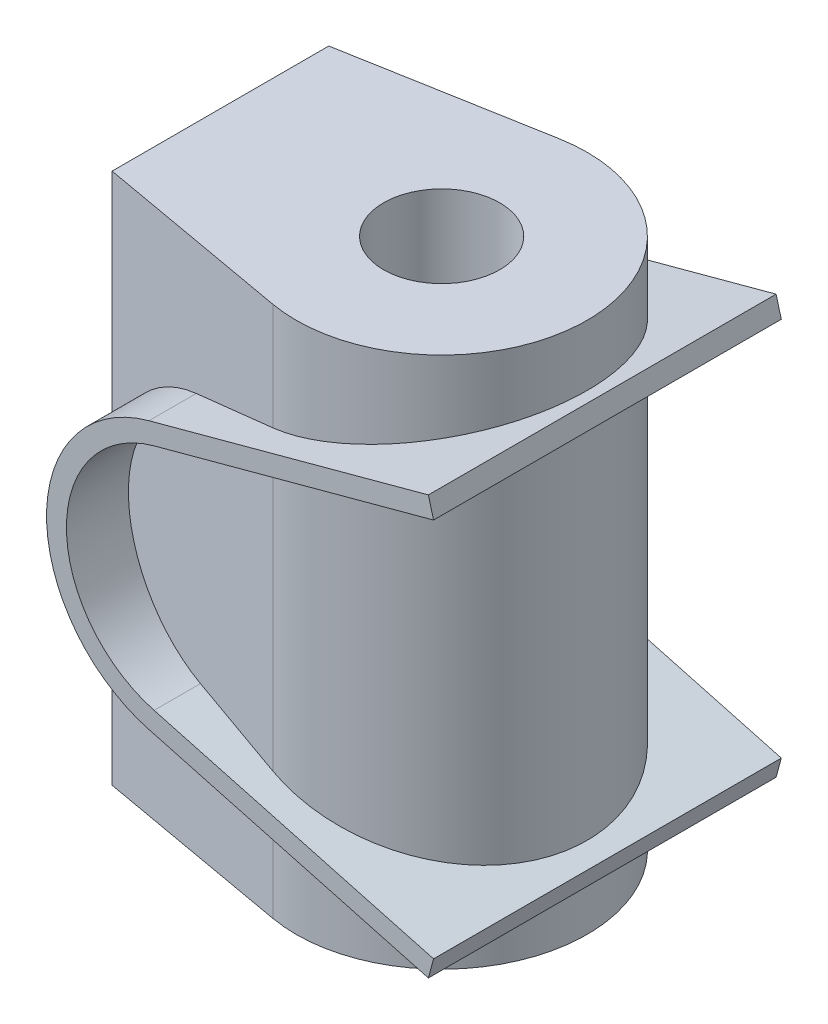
ISO-10303-21;
HEADER;
FILE_DESCRIPTION(('STEP AP214'),'2;1');
FILE_NAME('part.step','',(''),(''),'','','');
FILE_SCHEMA(('AUTOMOTIVE_DESIGN { 1 0 10303 214 1 1 1 1 }'));
ENDSEC;
DATA;
#1=APPLICATION_CONTEXT('core data for automotive mechanical design processes');
#2=APPLICATION_PROTOCOL_DEFINITION('international standard','automotive_design',2000,#1);
#3=PRODUCT_CONTEXT('',#1,'mechanical');
#4=PRODUCT('Part','Part','',(#3));
#5=PRODUCT_RELATED_PRODUCT_CATEGORY('part','',(#4));
#6=PRODUCT_DEFINITION_FORMATION('','',#4);
#7=PRODUCT_DEFINITION_CONTEXT('part definition',#1,'design');
#8=PRODUCT_DEFINITION('design','',#6,#7);
#9=PRODUCT_DEFINITION_SHAPE('','',#8);
#10=(LENGTH_UNIT() NAMED_UNIT(*) SI_UNIT(.MILLI.,.METRE.));
#11=(NAMED_UNIT(*) PLANE_ANGLE_UNIT() SI_UNIT($,.RADIAN.));
#12=(NAMED_UNIT(*) SI_UNIT($,.STERADIAN.) SOLID_ANGLE_UNIT());
#13=UNCERTAINTY_MEASURE_WITH_UNIT(LENGTH_MEASURE(1.E-05),#10,'distance_accuracy_value','');
#14=(GEOMETRIC_REPRESENTATION_CONTEXT(3) GLOBAL_UNCERTAINTY_ASSIGNED_CONTEXT((#13)) GLOBAL_UNIT_ASSIGNED_CONTEXT((#10,
#11,#12)) REPRESENTATION_CONTEXT('',''));
#15=CARTESIAN_POINT('',(0.,0.,0.));
#16=DIRECTION('',(0.,0.,1.));
#17=DIRECTION('',(1.,0.,0.));
#18=AXIS2_PLACEMENT_3D('',#15,#16,#17);
#19=CARTESIAN_POINT('',(10.5737978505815,33.9945272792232,0.));
#20=DIRECTION('',(0.,-1.,0.));
#21=DIRECTION('',(0.,0.,-1.));
#22=AXIS2_PLACEMENT_3D('',#19,#20,#21);
#23=PLANE('',#22);
#24=DIRECTION('',(0.,0.,1.));
#25=VECTOR('',#24,1.);
#26=CARTESIAN_POINT('',(-17.7041983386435,33.9945272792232,13.8475314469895));
#27=LINE('',#26,#25);
#28=CARTESIAN_POINT('',(-17.7041983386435,33.9945272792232,-13.8475314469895));
#29=VERTEX_POINT('',#28);
#30=CARTESIAN_POINT('',(-17.7041983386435,33.9945272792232,13.8475314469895));
#31=VERTEX_POINT('',#30);
#32=EDGE_CURVE('E105',#29,#31,#27,.T.);
#33=ORIENTED_EDGE('',*,*,#32,.T.);
#34=DIRECTION('',(0.984431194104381,0.,0.175770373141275));
#35=VECTOR('',#34,1.);
#36=CARTESIAN_POINT('',(7.30405130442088,33.9945272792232,18.3127590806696));
#37=LINE('',#36,#35);
#38=CARTESIAN_POINT('',(7.30405130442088,33.9945272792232,18.3127590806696));
#39=VERTEX_POINT('',#38);
#40=EDGE_CURVE('E90',#31,#39,#37,.T.);
#41=ORIENTED_EDGE('',*,*,#40,.T.);
#42=CARTESIAN_POINT('',(10.5737978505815,33.9945272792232,0.));
#43=DIRECTION('',(0.,1.,0.));
#44=DIRECTION('',(0.,0.,-1.));
#45=AXIS2_PLACEMENT_3D('',#42,#43,#44);
#46=CIRCLE('',#45,18.6023758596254);
#47=CARTESIAN_POINT('',(7.30405130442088,33.9945272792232,-18.3127590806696));
#48=VERTEX_POINT('',#47);
#49=EDGE_CURVE('E56',#39,#48,#46,.T.);
#50=ORIENTED_EDGE('',*,*,#49,.T.);
#51=DIRECTION('',(-0.984431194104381,0.,0.175770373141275));
#52=VECTOR('',#51,1.);
#53=CARTESIAN_POINT('',(-17.7041983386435,33.9945272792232,-13.8475314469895));
#54=LINE('',#53,#52);
#55=EDGE_CURVE('E51',#48,#29,#54,.T.);
#56=ORIENTED_EDGE('',*,*,#55,.T.);
#57=EDGE_LOOP('',(#33,#41,#50,#56));
#58=FACE_BOUND('',#57,.T.);
#59=CARTESIAN_POINT('',(10.5737978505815,33.9945272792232,0.));
#60=DIRECTION('',(0.,1.,0.));
#61=DIRECTION('',(0.,0.,1.));
#62=AXIS2_PLACEMENT_3D('',#59,#60,#61);
#63=CIRCLE('',#62,7.42305387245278);
#64=CARTESIAN_POINT('',(10.5737978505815,33.9945272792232,7.42305387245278));
#65=VERTEX_POINT('',#64);
#66=EDGE_CURVE('E95',#65,#65,#63,.T.);
#67=ORIENTED_EDGE('',*,*,#66,.F.);
#68=EDGE_LOOP('',(#67));
#69=FACE_BOUND('',#68,.T.);
#70=ADVANCED_FACE('F36',(#58,#69),#23,.F.);
#71=CARTESIAN_POINT('',(10.5737978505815,-33.9945272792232,0.));
#72=DIRECTION('',(0.,-1.,0.));
#73=DIRECTION('',(0.,0.,-1.));
#74=AXIS2_PLACEMENT_3D('',#71,#72,#73);
#75=PLANE('',#74);
#76=DIRECTION('',(0.,0.,1.));
#77=VECTOR('',#76,1.);
#78=CARTESIAN_POINT('',(-17.7041983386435,-33.9945272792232,13.8475314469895));
#79=LINE('',#78,#77);
#80=CARTESIAN_POINT('',(-17.7041983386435,-33.9945272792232,-13.8475314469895));
#81=VERTEX_POINT('',#80);
#82=CARTESIAN_POINT('',(-17.7041983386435,-33.9945272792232,13.8475314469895));
#83=VERTEX_POINT('',#82);
#84=EDGE_CURVE('E82',#81,#83,#79,.T.);
#85=ORIENTED_EDGE('',*,*,#84,.F.);
#86=DIRECTION('',(-0.984431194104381,0.,0.175770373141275));
#87=VECTOR('',#86,1.);
#88=CARTESIAN_POINT('',(-17.7041983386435,-33.9945272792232,-13.8475314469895));
#89=LINE('',#88,#87);
#90=CARTESIAN_POINT('',(7.30405130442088,-33.9945272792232,-18.3127590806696));
#91=VERTEX_POINT('',#90);
#92=EDGE_CURVE('E103',#91,#81,#89,.T.);
#93=ORIENTED_EDGE('',*,*,#92,.F.);
#94=CARTESIAN_POINT('',(10.5737978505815,-33.9945272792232,0.));
#95=DIRECTION('',(0.,1.,0.));
#96=DIRECTION('',(0.,0.,-1.));
#97=AXIS2_PLACEMENT_3D('',#94,#95,#96);
#98=CIRCLE('',#97,18.6023758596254);
#99=CARTESIAN_POINT('',(7.30405130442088,-33.9945272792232,18.3127590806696));
#100=VERTEX_POINT('',#99);
#101=EDGE_CURVE('E83',#100,#91,#98,.T.);
#102=ORIENTED_EDGE('',*,*,#101,.F.);
#103=DIRECTION('',(0.984431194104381,0.,0.175770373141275));
#104=VECTOR('',#103,1.);
#105=CARTESIAN_POINT('',(7.30405130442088,-33.9945272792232,18.3127590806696));
#106=LINE('',#105,#104);
#107=EDGE_CURVE('E77',#83,#100,#106,.T.);
#108=ORIENTED_EDGE('',*,*,#107,.F.);
#109=EDGE_LOOP('',(#85,#93,#102,#108));
#110=FACE_BOUND('',#109,.T.);
#111=CARTESIAN_POINT('',(10.5737978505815,-33.9945272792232,0.));
#112=DIRECTION('',(0.,1.,0.));
#113=DIRECTION('',(0.,0.,1.));
#114=AXIS2_PLACEMENT_3D('',#111,#112,#113);
#115=CIRCLE('',#114,7.42305387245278);
#116=CARTESIAN_POINT('',(10.5737978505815,-33.9945272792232,7.42305387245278));
#117=VERTEX_POINT('',#116);
#118=EDGE_CURVE('E98',#117,#117,#115,.T.);
#119=ORIENTED_EDGE('',*,*,#118,.T.);
#120=EDGE_LOOP('',(#119));
#121=FACE_BOUND('',#120,.T.);
#122=ADVANCED_FACE('F78',(#110,#121),#75,.T.);
#123=CARTESIAN_POINT('',(-17.7041983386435,33.9945272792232,13.8475314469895));
#124=DIRECTION('',(1.,0.,0.));
#125=DIRECTION('',(0.,0.,-1.));
#126=AXIS2_PLACEMENT_3D('',#123,#124,#125);
#127=PLANE('',#126);
#128=ORIENTED_EDGE('',*,*,#84,.T.);
#129=DIRECTION('',(0.,-1.,0.));
#130=VECTOR('',#129,1.);
#131=CARTESIAN_POINT('',(-17.7041983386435,33.9945272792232,13.8475314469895));
#132=LINE('',#131,#130);
#133=EDGE_CURVE('E12',#31,#83,#132,.T.);
#134=ORIENTED_EDGE('',*,*,#133,.F.);
#135=ORIENTED_EDGE('',*,*,#32,.F.);
#136=DIRECTION('',(0.,-1.,0.));
#137=VECTOR('',#136,1.);
#138=CARTESIAN_POINT('',(-17.7041983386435,33.9945272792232,-13.8475314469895));
#139=LINE('',#138,#137);
#140=EDGE_CURVE('E94',#29,#81,#139,.T.);
#141=ORIENTED_EDGE('',*,*,#140,.T.);
#142=EDGE_LOOP('',(#128,#134,#135,#141));
#143=FACE_BOUND('',#142,.T.);
#144=ADVANCED_FACE('F38',(#143),#127,.F.);
#145=CARTESIAN_POINT('',(7.30405130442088,33.9945272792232,18.3127590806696));
#146=DIRECTION('',(0.175770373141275,0.,-0.984431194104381));
#147=DIRECTION('',(-0.984431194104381,0.,-0.175770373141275));
#148=AXIS2_PLACEMENT_3D('',#145,#146,#147);
#149=PLANE('',#148);
#150=ORIENTED_EDGE('',*,*,#107,.T.);
#151=DIRECTION('',(0.,-1.,0.));
#152=VECTOR('',#151,1.);
#153=CARTESIAN_POINT('',(7.30405130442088,33.9945272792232,18.3127590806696));
#154=LINE('',#153,#152);
#155=EDGE_CURVE('E44',#39,#100,#154,.T.);
#156=ORIENTED_EDGE('',*,*,#155,.F.);
#157=ORIENTED_EDGE('',*,*,#40,.F.);
#158=ORIENTED_EDGE('',*,*,#133,.T.);
#159=EDGE_LOOP('',(#150,#156,#157,#158));
#160=FACE_BOUND('',#159,.T.);
#161=ADVANCED_FACE('F89',(#160),#149,.F.);
#162=CARTESIAN_POINT('',(10.5737978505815,33.9945272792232,0.));
#163=DIRECTION('',(0.,-1.,0.));
#164=DIRECTION('',(0.,0.,-1.));
#165=AXIS2_PLACEMENT_3D('',#162,#163,#164);
#166=CYLINDRICAL_SURFACE('',#165,18.6023758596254);
#167=ORIENTED_EDGE('',*,*,#101,.T.);
#168=DIRECTION('',(0.,-1.,0.));
#169=VECTOR('',#168,1.);
#170=CARTESIAN_POINT('',(7.30405130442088,33.9945272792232,-18.3127590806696));
#171=LINE('',#170,#169);
#172=EDGE_CURVE('E111',#48,#91,#171,.T.);
#173=ORIENTED_EDGE('',*,*,#172,.F.);
#174=ORIENTED_EDGE('',*,*,#49,.F.);
#175=ORIENTED_EDGE('',*,*,#155,.T.);
#176=EDGE_LOOP('',(#167,#173,#174,#175));
#177=FACE_BOUND('',#176,.T.);
#178=ADVANCED_FACE('F114',(#177),#166,.T.);
#179=CARTESIAN_POINT('',(-17.7041983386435,33.9945272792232,-13.8475314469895));
#180=DIRECTION('',(0.175770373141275,0.,0.984431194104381));
#181=DIRECTION('',(0.984431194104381,0.,-0.175770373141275));
#182=AXIS2_PLACEMENT_3D('',#179,#180,#181);
#183=PLANE('',#182);
#184=ORIENTED_EDGE('',*,*,#92,.T.);
#185=ORIENTED_EDGE('',*,*,#140,.F.);
#186=ORIENTED_EDGE('',*,*,#55,.F.);
#187=ORIENTED_EDGE('',*,*,#172,.T.);
#188=EDGE_LOOP('',(#184,#185,#186,#187));
#189=FACE_BOUND('',#188,.T.);
#190=ADVANCED_FACE('F116',(#189),#183,.F.);
#191=CARTESIAN_POINT('',(10.5737978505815,33.9945272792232,0.));
#192=DIRECTION('',(0.,-1.,0.));
#193=DIRECTION('',(0.,0.,-1.));
#194=AXIS2_PLACEMENT_3D('',#191,#192,#193);
#195=CYLINDRICAL_SURFACE('',#194,7.42305387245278);
#196=ORIENTED_EDGE('',*,*,#66,.T.);
#197=EDGE_LOOP('',(#196));
#198=FACE_BOUND('',#197,.T.);
#199=ORIENTED_EDGE('',*,*,#118,.F.);
#200=EDGE_LOOP('',(#199));
#201=FACE_BOUND('',#200,.T.);
#202=ADVANCED_FACE('F122',(#198,#201),#195,.F.);
#203=CLOSED_SHELL('',(#70,#122,#144,#161,#178,#190,#202));
#204=MANIFOLD_SOLID_BREP('B2',#203);
#205=CARTESIAN_POINT('',(-4.61658955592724,-17.0916862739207,22.225));
#206=DIRECTION('',(0.260762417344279,0.965403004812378,0.));
#207=DIRECTION('',(-0.965403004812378,0.260762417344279,0.));
#208=AXIS2_PLACEMENT_3D('',#205,#206,#207);
#209=PLANE('',#208);
#210=DIRECTION('',(0.965403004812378,-0.260762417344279,0.));
#211=VECTOR('',#210,1.);
#212=CARTESIAN_POINT('',(-4.61658955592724,-17.0916862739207,-22.225));
#213=LINE('',#212,#211);
#214=CARTESIAN_POINT('',(-4.61658955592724,-17.0916862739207,-22.225));
#215=VERTEX_POINT('',#214);
#216=CARTESIAN_POINT('',(31.1015078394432,-26.7394057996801,-22.225));
#217=VERTEX_POINT('',#216);
#218=EDGE_CURVE('E241',#215,#217,#213,.T.);
#219=ORIENTED_EDGE('',*,*,#218,.T.);
#220=DIRECTION('',(0.,0.,-1.));
#221=VECTOR('',#220,1.);
#222=CARTESIAN_POINT('',(31.1015078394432,-26.7394057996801,22.225));
#223=LINE('',#222,#221);
#224=CARTESIAN_POINT('',(31.1015078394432,-26.7394057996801,22.225));
#225=VERTEX_POINT('',#224);
#226=EDGE_CURVE('E34',#225,#217,#223,.T.);
#227=ORIENTED_EDGE('',*,*,#226,.F.);
#228=DIRECTION('',(0.965403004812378,-0.260762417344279,0.));
#229=VECTOR('',#228,1.);
#230=CARTESIAN_POINT('',(-4.61658955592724,-17.0916862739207,22.225));
#231=LINE('',#230,#229);
#232=CARTESIAN_POINT('',(-4.61658955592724,-17.0916862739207,22.225));
#233=VERTEX_POINT('',#232);
#234=EDGE_CURVE('E265',#233,#225,#231,.T.);
#235=ORIENTED_EDGE('',*,*,#234,.F.);
#236=DIRECTION('',(0.,0.,-1.));
#237=VECTOR('',#236,1.);
#238=CARTESIAN_POINT('',(-4.61658955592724,-17.0916862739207,22.225));
#239=LINE('',#238,#237);
#240=EDGE_CURVE('E242',#233,#215,#239,.T.);
#241=ORIENTED_EDGE('',*,*,#240,.T.);
#242=EDGE_LOOP('',(#219,#227,#235,#241));
#243=FACE_BOUND('',#242,.T.);
#244=ADVANCED_FACE('F166',(#243),#209,.F.);
#245=CARTESIAN_POINT('',(31.7638443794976,-24.2872821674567,22.225));
#246=DIRECTION('',(0.965403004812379,-0.260762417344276,0.));
#247=DIRECTION('',(0.260762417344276,0.965403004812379,0.));
#248=AXIS2_PLACEMENT_3D('',#245,#246,#247);
#249=PLANE('',#248);
#250=DIRECTION('',(-0.260762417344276,-0.965403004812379,0.));
#251=VECTOR('',#250,1.);
#252=CARTESIAN_POINT('',(31.7638443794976,-24.2872821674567,-22.225));
#253=LINE('',#252,#251);
#254=CARTESIAN_POINT('',(31.7638443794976,-24.2872821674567,-22.225));
#255=VERTEX_POINT('',#254);
#256=EDGE_CURVE('E233',#255,#217,#253,.T.);
#257=ORIENTED_EDGE('',*,*,#256,.F.);
#258=DIRECTION('',(0.,0.,-1.));
#259=VECTOR('',#258,1.);
#260=CARTESIAN_POINT('',(31.7638443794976,-24.2872821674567,22.225));
#261=LINE('',#260,#259);
#262=CARTESIAN_POINT('',(31.7638443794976,-24.2872821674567,22.225));
#263=VERTEX_POINT('',#262);
#264=EDGE_CURVE('E173',#263,#255,#261,.T.);
#265=ORIENTED_EDGE('',*,*,#264,.F.);
#266=DIRECTION('',(-0.260762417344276,-0.965403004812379,0.));
#267=VECTOR('',#266,1.);
#268=CARTESIAN_POINT('',(31.7638443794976,-24.2872821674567,22.225));
#269=LINE('',#268,#267);
#270=EDGE_CURVE('E236',#263,#225,#269,.T.);
#271=ORIENTED_EDGE('',*,*,#270,.T.);
#272=ORIENTED_EDGE('',*,*,#226,.T.);
#273=EDGE_LOOP('',(#257,#265,#271,#272));
#274=FACE_BOUND('',#273,.T.);
#275=ADVANCED_FACE('F231',(#274),#249,.T.);
#276=CARTESIAN_POINT('',(-3.95425301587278,-14.6395626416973,22.225));
#277=DIRECTION('',(0.260762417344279,0.965403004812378,0.));
#278=DIRECTION('',(-0.965403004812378,0.260762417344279,0.));
#279=AXIS2_PLACEMENT_3D('',#276,#277,#278);
#280=PLANE('',#279);
#281=DIRECTION('',(0.965403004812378,-0.260762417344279,0.));
#282=VECTOR('',#281,1.);
#283=CARTESIAN_POINT('',(-3.95425301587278,-14.6395626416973,-22.225));
#284=LINE('',#283,#282);
#285=CARTESIAN_POINT('',(-3.95425301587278,-14.6395626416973,-22.225));
#286=VERTEX_POINT('',#285);
#287=EDGE_CURVE('E249',#286,#255,#284,.T.);
#288=ORIENTED_EDGE('',*,*,#287,.F.);
#289=DIRECTION('',(0.,0.,-1.));
#290=VECTOR('',#289,1.);
#291=CARTESIAN_POINT('',(-3.95425301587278,-14.6395626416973,22.225));
#292=LINE('',#291,#290);
#293=CARTESIAN_POINT('',(-3.95425301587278,-14.6395626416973,22.225));
#294=VERTEX_POINT('',#293);
#295=EDGE_CURVE('E292',#294,#286,#292,.T.);
#296=ORIENTED_EDGE('',*,*,#295,.F.);
#297=DIRECTION('',(0.965403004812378,-0.260762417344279,0.));
#298=VECTOR('',#297,1.);
#299=CARTESIAN_POINT('',(-3.95425301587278,-14.6395626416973,22.225));
#300=LINE('',#299,#298);
#301=EDGE_CURVE('E268',#294,#263,#300,.T.);
#302=ORIENTED_EDGE('',*,*,#301,.T.);
#303=ORIENTED_EDGE('',*,*,#264,.T.);
#304=EDGE_LOOP('',(#288,#296,#302,#303));
#305=FACE_BOUND('',#304,.T.);
#306=ADVANCED_FACE('F294',(#305),#280,.T.);
#307=CARTESIAN_POINT('',(0.,0.,22.225));
#308=DIRECTION('',(0.,0.,-1.));
#309=DIRECTION('',(-1.,0.,0.));
#310=AXIS2_PLACEMENT_3D('',#307,#308,#309);
#311=CYLINDRICAL_SURFACE('',#310,15.1641983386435);
#312=CARTESIAN_POINT('',(0.,0.,-22.225));
#313=DIRECTION('',(0.,0.,1.));
#314=DIRECTION('',(1.,0.,0.));
#315=AXIS2_PLACEMENT_3D('',#312,#313,#314);
#316=CIRCLE('',#315,15.1641983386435);
#317=CARTESIAN_POINT('',(-3.95425301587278,14.6395626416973,-22.225));
#318=VERTEX_POINT('',#317);
#319=EDGE_CURVE('E251',#318,#286,#316,.T.);
#320=ORIENTED_EDGE('',*,*,#319,.F.);
#321=DIRECTION('',(0.,0.,-1.));
#322=VECTOR('',#321,1.);
#323=CARTESIAN_POINT('',(-3.95425301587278,14.6395626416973,22.225));
#324=LINE('',#323,#322);
#325=CARTESIAN_POINT('',(-3.95425301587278,14.6395626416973,22.225));
#326=VERTEX_POINT('',#325);
#327=EDGE_CURVE('E290',#326,#318,#324,.T.);
#328=ORIENTED_EDGE('',*,*,#327,.F.);
#329=CARTESIAN_POINT('',(0.,0.,22.225));
#330=DIRECTION('',(0.,0.,1.));
#331=DIRECTION('',(1.,0.,0.));
#332=AXIS2_PLACEMENT_3D('',#329,#330,#331);
#333=CIRCLE('',#332,15.1641983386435);
#334=EDGE_CURVE('E271',#326,#294,#333,.T.);
#335=ORIENTED_EDGE('',*,*,#334,.T.);
#336=ORIENTED_EDGE('',*,*,#295,.T.);
#337=EDGE_LOOP('',(#320,#328,#335,#336));
#338=FACE_BOUND('',#337,.T.);
#339=ADVANCED_FACE('F301',(#338),#311,.F.);
#340=CARTESIAN_POINT('',(-3.95425301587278,14.6395626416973,22.225));
#341=DIRECTION('',(0.260762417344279,-0.965403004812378,0.));
#342=DIRECTION('',(0.965403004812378,0.260762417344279,0.));
#343=AXIS2_PLACEMENT_3D('',#340,#341,#342);
#344=PLANE('',#343);
#345=DIRECTION('',(-0.965403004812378,-0.260762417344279,0.));
#346=VECTOR('',#345,1.);
#347=CARTESIAN_POINT('',(-3.95425301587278,14.6395626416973,-22.225));
#348=LINE('',#347,#346);
#349=CARTESIAN_POINT('',(31.7638443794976,24.2872821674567,-22.225));
#350=VERTEX_POINT('',#349);
#351=EDGE_CURVE('E255',#350,#318,#348,.T.);
#352=ORIENTED_EDGE('',*,*,#351,.F.);
#353=DIRECTION('',(0.,0.,-1.));
#354=VECTOR('',#353,1.);
#355=CARTESIAN_POINT('',(31.7638443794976,24.2872821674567,22.225));
#356=LINE('',#355,#354);
#357=CARTESIAN_POINT('',(31.7638443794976,24.2872821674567,22.225));
#358=VERTEX_POINT('',#357);
#359=EDGE_CURVE('E288',#358,#350,#356,.T.);
#360=ORIENTED_EDGE('',*,*,#359,.F.);
#361=DIRECTION('',(-0.965403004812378,-0.260762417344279,0.));
#362=VECTOR('',#361,1.);
#363=CARTESIAN_POINT('',(-3.95425301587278,14.6395626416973,22.225));
#364=LINE('',#363,#362);
#365=EDGE_CURVE('E274',#358,#326,#364,.T.);
#366=ORIENTED_EDGE('',*,*,#365,.T.);
#367=ORIENTED_EDGE('',*,*,#327,.T.);
#368=EDGE_LOOP('',(#352,#360,#366,#367));
#369=FACE_BOUND('',#368,.T.);
#370=ADVANCED_FACE('F304',(#369),#344,.T.);
#371=CARTESIAN_POINT('',(31.1015078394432,26.7394057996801,22.225));
#372=DIRECTION('',(0.965403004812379,0.260762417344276,0.));
#373=DIRECTION('',(-0.260762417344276,0.965403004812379,0.));
#374=AXIS2_PLACEMENT_3D('',#371,#372,#373);
#375=PLANE('',#374);
#376=DIRECTION('',(0.260762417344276,-0.965403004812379,0.));
#377=VECTOR('',#376,1.);
#378=CARTESIAN_POINT('',(31.1015078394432,26.7394057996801,-22.225));
#379=LINE('',#378,#377);
#380=CARTESIAN_POINT('',(31.1015078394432,26.7394057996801,-22.225));
#381=VERTEX_POINT('',#380);
#382=EDGE_CURVE('E258',#381,#350,#379,.T.);
#383=ORIENTED_EDGE('',*,*,#382,.F.);
#384=DIRECTION('',(0.,0.,-1.));
#385=VECTOR('',#384,1.);
#386=CARTESIAN_POINT('',(31.1015078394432,26.7394057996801,22.225));
#387=LINE('',#386,#385);
#388=CARTESIAN_POINT('',(31.1015078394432,26.7394057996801,22.225));
#389=VERTEX_POINT('',#388);
#390=EDGE_CURVE('E286',#389,#381,#387,.T.);
#391=ORIENTED_EDGE('',*,*,#390,.F.);
#392=DIRECTION('',(0.260762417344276,-0.965403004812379,0.));
#393=VECTOR('',#392,1.);
#394=CARTESIAN_POINT('',(31.1015078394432,26.7394057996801,22.225));
#395=LINE('',#394,#393);
#396=EDGE_CURVE('E277',#389,#358,#395,.T.);
#397=ORIENTED_EDGE('',*,*,#396,.T.);
#398=ORIENTED_EDGE('',*,*,#359,.T.);
#399=EDGE_LOOP('',(#383,#391,#397,#398));
#400=FACE_BOUND('',#399,.T.);
#401=ADVANCED_FACE('F307',(#400),#375,.T.);
#402=CARTESIAN_POINT('',(-4.61658955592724,17.0916862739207,22.225));
#403=DIRECTION('',(0.260762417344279,-0.965403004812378,0.));
#404=DIRECTION('',(0.965403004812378,0.260762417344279,0.));
#405=AXIS2_PLACEMENT_3D('',#402,#403,#404);
#406=PLANE('',#405);
#407=DIRECTION('',(-0.965403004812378,-0.260762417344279,0.));
#408=VECTOR('',#407,1.);
#409=CARTESIAN_POINT('',(-4.61658955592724,17.0916862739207,-22.225));
#410=LINE('',#409,#408);
#411=CARTESIAN_POINT('',(-4.61658955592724,17.0916862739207,-22.225));
#412=VERTEX_POINT('',#411);
#413=EDGE_CURVE('E261',#381,#412,#410,.T.);
#414=ORIENTED_EDGE('',*,*,#413,.T.);
#415=DIRECTION('',(0.,0.,-1.));
#416=VECTOR('',#415,1.);
#417=CARTESIAN_POINT('',(-4.61658955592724,17.0916862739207,22.225));
#418=LINE('',#417,#416);
#419=CARTESIAN_POINT('',(-4.61658955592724,17.0916862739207,22.225));
#420=VERTEX_POINT('',#419);
#421=EDGE_CURVE('E283',#420,#412,#418,.T.);
#422=ORIENTED_EDGE('',*,*,#421,.F.);
#423=DIRECTION('',(-0.965403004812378,-0.260762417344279,0.));
#424=VECTOR('',#423,1.);
#425=CARTESIAN_POINT('',(-4.61658955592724,17.0916862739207,22.225));
#426=LINE('',#425,#424);
#427=EDGE_CURVE('E185',#389,#420,#426,.T.);
#428=ORIENTED_EDGE('',*,*,#427,.F.);
#429=ORIENTED_EDGE('',*,*,#390,.T.);
#430=EDGE_LOOP('',(#414,#422,#428,#429));
#431=FACE_BOUND('',#430,.T.);
#432=ADVANCED_FACE('F310',(#431),#406,.F.);
#433=CARTESIAN_POINT('',(0.,0.,22.225));
#434=DIRECTION('',(0.,0.,-1.));
#435=DIRECTION('',(-1.,0.,0.));
#436=AXIS2_PLACEMENT_3D('',#433,#434,#435);
#437=CYLINDRICAL_SURFACE('',#436,17.7041983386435);
#438=CARTESIAN_POINT('',(0.,0.,-22.225));
#439=DIRECTION('',(0.,0.,1.));
#440=DIRECTION('',(1.,0.,0.));
#441=AXIS2_PLACEMENT_3D('',#438,#439,#440);
#442=CIRCLE('',#441,17.7041983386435);
#443=EDGE_CURVE('E263',#412,#215,#442,.T.);
#444=ORIENTED_EDGE('',*,*,#443,.T.);
#445=ORIENTED_EDGE('',*,*,#240,.F.);
#446=CARTESIAN_POINT('',(0.,0.,22.225));
#447=DIRECTION('',(0.,0.,1.));
#448=DIRECTION('',(1.,0.,0.));
#449=AXIS2_PLACEMENT_3D('',#446,#447,#448);
#450=CIRCLE('',#449,17.7041983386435);
#451=EDGE_CURVE('E180',#420,#233,#450,.T.);
#452=ORIENTED_EDGE('',*,*,#451,.F.);
#453=ORIENTED_EDGE('',*,*,#421,.T.);
#454=EDGE_LOOP('',(#444,#445,#452,#453));
#455=FACE_BOUND('',#454,.T.);
#456=ADVANCED_FACE('F312',(#455),#437,.T.);
#457=CARTESIAN_POINT('',(0.,0.,22.225));
#458=DIRECTION('',(0.,0.,1.));
#459=DIRECTION('',(1.,0.,0.));
#460=AXIS2_PLACEMENT_3D('',#457,#458,#459);
#461=PLANE('',#460);
#462=ORIENTED_EDGE('',*,*,#234,.T.);
#463=ORIENTED_EDGE('',*,*,#270,.F.);
#464=ORIENTED_EDGE('',*,*,#301,.F.);
#465=ORIENTED_EDGE('',*,*,#334,.F.);
#466=ORIENTED_EDGE('',*,*,#365,.F.);
#467=ORIENTED_EDGE('',*,*,#396,.F.);
#468=ORIENTED_EDGE('',*,*,#427,.T.);
#469=ORIENTED_EDGE('',*,*,#451,.T.);
#470=EDGE_LOOP('',(#462,#463,#464,#465,#466,#467,#468,#469));
#471=FACE_BOUND('',#470,.T.);
#472=ADVANCED_FACE('F296',(#471),#461,.T.);
#473=CARTESIAN_POINT('',(0.,0.,-22.225));
#474=DIRECTION('',(0.,0.,1.));
#475=DIRECTION('',(1.,0.,0.));
#476=AXIS2_PLACEMENT_3D('',#473,#474,#475);
#477=PLANE('',#476);
#478=ORIENTED_EDGE('',*,*,#218,.F.);
#479=ORIENTED_EDGE('',*,*,#443,.F.);
#480=ORIENTED_EDGE('',*,*,#413,.F.);
#481=ORIENTED_EDGE('',*,*,#382,.T.);
#482=ORIENTED_EDGE('',*,*,#351,.T.);
#483=ORIENTED_EDGE('',*,*,#319,.T.);
#484=ORIENTED_EDGE('',*,*,#287,.T.);
#485=ORIENTED_EDGE('',*,*,#256,.T.);
#486=EDGE_LOOP('',(#478,#479,#480,#481,#482,#483,#484,#485));
#487=FACE_BOUND('',#486,.T.);
#488=ADVANCED_FACE('F246',(#487),#477,.F.);
#489=CLOSED_SHELL('',(#244,#275,#306,#339,#370,#401,#432,#456,#472,#488));
#490=MANIFOLD_SOLID_BREP('B6',#489);
#491=ADVANCED_BREP_SHAPE_REPRESENTATION('',(#18,#204,#490),#14);
#492=SHAPE_DEFINITION_REPRESENTATION(#9,#491);
ENDSEC;
END-ISO-10303-21;
